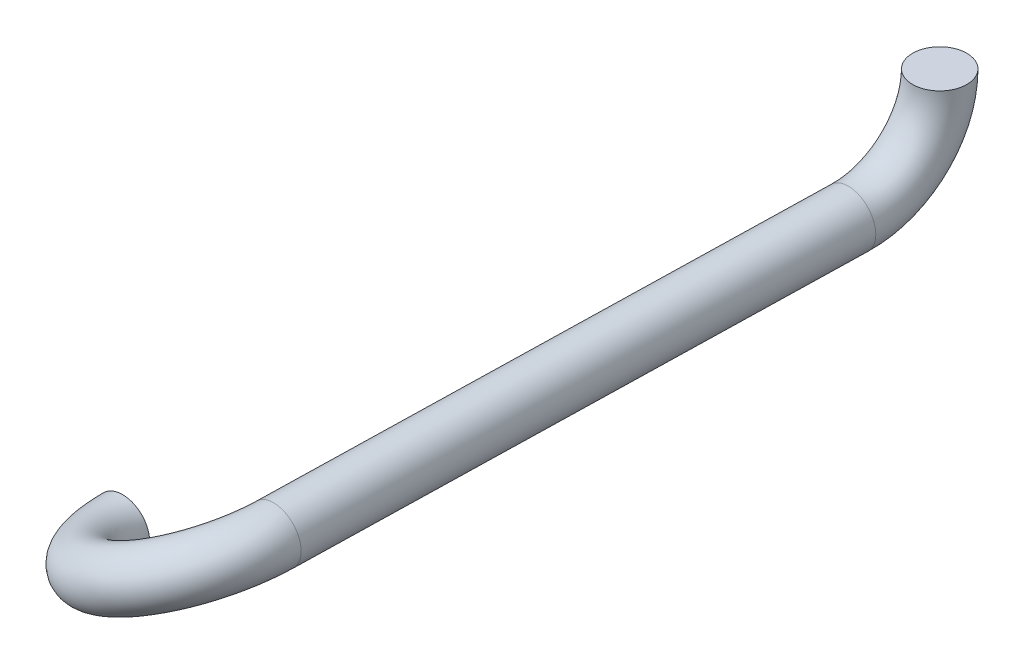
from build123d import *

# Parameters (mm, degrees)
SKETCH2_R = 3.96875


with BuildPart() as part:
    # Sweep2: sweep along a curve in space
    with BuildLine() as sweep2_path:
        ThreePointArc((27.14752, 25.273, -92.6338), (26.984352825, 16.261859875, -88.959358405), (26.588058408, 12.398215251, -80.035010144))
        Line((26.588058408, 12.398215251, -80.035010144), (23.006426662, 10.728072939, 0.621510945))
        ThreePointArc((0, 0, 0), (11.228384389, 5.235881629, 12.696195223), (23.006426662, 10.728072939, 0.621510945))
    # Sketch2 → Sweep2 (sweep)
    with BuildSketch(Plane.XY):
        Circle(SKETCH2_R)
    sweep(path=sweep2_path.line)


solid = part.part
